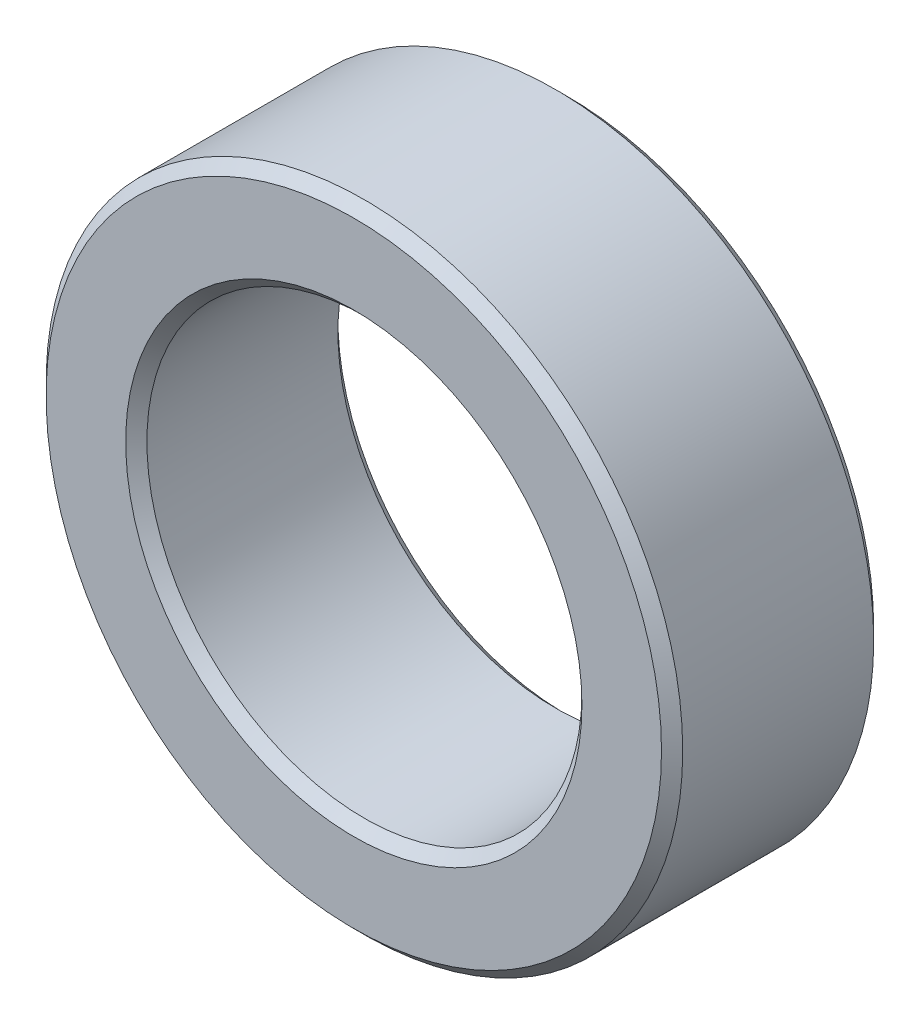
ISO-10303-21;
HEADER;
FILE_DESCRIPTION(('STEP AP214'),'2;1');
FILE_NAME('part.step','',(''),(''),'','','');
FILE_SCHEMA(('AUTOMOTIVE_DESIGN { 1 0 10303 214 1 1 1 1 }'));
ENDSEC;
DATA;
#1=APPLICATION_CONTEXT('core data for automotive mechanical design processes');
#2=APPLICATION_PROTOCOL_DEFINITION('international standard','automotive_design',2000,#1);
#3=PRODUCT_CONTEXT('',#1,'mechanical');
#4=PRODUCT('Part','Part','',(#3));
#5=PRODUCT_RELATED_PRODUCT_CATEGORY('part','',(#4));
#6=PRODUCT_DEFINITION_FORMATION('','',#4);
#7=PRODUCT_DEFINITION_CONTEXT('part definition',#1,'design');
#8=PRODUCT_DEFINITION('design','',#6,#7);
#9=PRODUCT_DEFINITION_SHAPE('','',#8);
#10=(LENGTH_UNIT() NAMED_UNIT(*) SI_UNIT(.MILLI.,.METRE.));
#11=(NAMED_UNIT(*) PLANE_ANGLE_UNIT() SI_UNIT($,.RADIAN.));
#12=(NAMED_UNIT(*) SI_UNIT($,.STERADIAN.) SOLID_ANGLE_UNIT());
#13=UNCERTAINTY_MEASURE_WITH_UNIT(LENGTH_MEASURE(1.E-05),#10,'distance_accuracy_value','');
#14=(GEOMETRIC_REPRESENTATION_CONTEXT(3) GLOBAL_UNCERTAINTY_ASSIGNED_CONTEXT((#13)) GLOBAL_UNIT_ASSIGNED_CONTEXT((#10,
#11,#12)) REPRESENTATION_CONTEXT('',''));
#15=CARTESIAN_POINT('',(0.,0.,0.));
#16=DIRECTION('',(0.,0.,1.));
#17=DIRECTION('',(1.,0.,0.));
#18=AXIS2_PLACEMENT_3D('',#15,#16,#17);
#19=CARTESIAN_POINT('',(0.,0.,2.));
#20=DIRECTION('',(0.,0.,1.));
#21=DIRECTION('',(1.,0.,0.));
#22=AXIS2_PLACEMENT_3D('',#19,#20,#21);
#23=PLANE('',#22);
#24=CARTESIAN_POINT('',(0.,0.,2.));
#25=DIRECTION('',(0.,0.,1.));
#26=DIRECTION('',(1.,0.,0.));
#27=AXIS2_PLACEMENT_3D('',#24,#25,#26);
#28=CIRCLE('',#27,4.3);
#29=CARTESIAN_POINT('',(4.3,0.,2.));
#30=VERTEX_POINT('',#29);
#31=EDGE_CURVE('E10',#30,#30,#28,.F.);
#32=ORIENTED_EDGE('',*,*,#31,.T.);
#33=EDGE_LOOP('',(#32));
#34=FACE_BOUND('',#33,.T.);
#35=CARTESIAN_POINT('',(0.,0.,2.));
#36=DIRECTION('',(0.,0.,1.));
#37=DIRECTION('',(1.,0.,0.));
#38=AXIS2_PLACEMENT_3D('',#35,#36,#37);
#39=CIRCLE('',#38,5.8);
#40=CARTESIAN_POINT('',(5.8,0.,2.));
#41=VERTEX_POINT('',#40);
#42=EDGE_CURVE('E45',#41,#41,#39,.T.);
#43=ORIENTED_EDGE('',*,*,#42,.T.);
#44=EDGE_LOOP('',(#43));
#45=FACE_BOUND('',#44,.T.);
#46=ADVANCED_FACE('F37',(#34,#45),#23,.T.);
#47=CARTESIAN_POINT('',(0.,0.,-2.));
#48=DIRECTION('',(0.,0.,1.));
#49=DIRECTION('',(1.,0.,0.));
#50=AXIS2_PLACEMENT_3D('',#47,#48,#49);
#51=PLANE('',#50);
#52=CARTESIAN_POINT('',(0.,0.,-2.));
#53=DIRECTION('',(0.,0.,1.));
#54=DIRECTION('',(1.,0.,0.));
#55=AXIS2_PLACEMENT_3D('',#52,#53,#54);
#56=CIRCLE('',#55,5.8);
#57=CARTESIAN_POINT('',(5.8,0.,-2.));
#58=VERTEX_POINT('',#57);
#59=EDGE_CURVE('E63',#58,#58,#56,.F.);
#60=ORIENTED_EDGE('',*,*,#59,.T.);
#61=EDGE_LOOP('',(#60));
#62=FACE_BOUND('',#61,.T.);
#63=CARTESIAN_POINT('',(0.,0.,-2.));
#64=DIRECTION('',(0.,0.,1.));
#65=DIRECTION('',(1.,0.,0.));
#66=AXIS2_PLACEMENT_3D('',#63,#64,#65);
#67=CIRCLE('',#66,4.3);
#68=CARTESIAN_POINT('',(4.3,0.,-2.));
#69=VERTEX_POINT('',#68);
#70=EDGE_CURVE('E67',#69,#69,#67,.T.);
#71=ORIENTED_EDGE('',*,*,#70,.T.);
#72=EDGE_LOOP('',(#71));
#73=FACE_BOUND('',#72,.T.);
#74=ADVANCED_FACE('F89',(#62,#73),#51,.F.);
#75=CARTESIAN_POINT('',(0.,0.,2.));
#76=DIRECTION('',(0.,0.,-1.));
#77=DIRECTION('',(-1.,0.,0.));
#78=AXIS2_PLACEMENT_3D('',#75,#76,#77);
#79=CYLINDRICAL_SURFACE('',#78,6.);
#80=CARTESIAN_POINT('',(0.,0.,-1.8));
#81=DIRECTION('',(0.,0.,1.));
#82=DIRECTION('',(1.,0.,0.));
#83=AXIS2_PLACEMENT_3D('',#80,#81,#82);
#84=CIRCLE('',#83,6.);
#85=CARTESIAN_POINT('',(6.,0.,-1.8));
#86=VERTEX_POINT('',#85);
#87=EDGE_CURVE('E70',#86,#86,#84,.T.);
#88=ORIENTED_EDGE('',*,*,#87,.T.);
#89=EDGE_LOOP('',(#88));
#90=FACE_BOUND('',#89,.T.);
#91=CARTESIAN_POINT('',(0.,0.,1.79999999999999));
#92=DIRECTION('',(0.,0.,1.));
#93=DIRECTION('',(1.,0.,0.));
#94=AXIS2_PLACEMENT_3D('',#91,#92,#93);
#95=CIRCLE('',#94,6.);
#96=CARTESIAN_POINT('',(6.,0.,1.79999999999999));
#97=VERTEX_POINT('',#96);
#98=EDGE_CURVE('E73',#97,#97,#95,.F.);
#99=ORIENTED_EDGE('',*,*,#98,.T.);
#100=EDGE_LOOP('',(#99));
#101=FACE_BOUND('',#100,.T.);
#102=ADVANCED_FACE('F78',(#90,#101),#79,.T.);
#103=CARTESIAN_POINT('',(0.,0.,2.));
#104=DIRECTION('',(0.,0.,-1.));
#105=DIRECTION('',(-1.,0.,0.));
#106=AXIS2_PLACEMENT_3D('',#103,#104,#105);
#107=CYLINDRICAL_SURFACE('',#106,4.1);
#108=CARTESIAN_POINT('',(0.,0.,-1.8));
#109=DIRECTION('',(0.,0.,1.));
#110=DIRECTION('',(1.,0.,0.));
#111=AXIS2_PLACEMENT_3D('',#108,#109,#110);
#112=CIRCLE('',#111,4.1);
#113=CARTESIAN_POINT('',(4.1,0.,-1.8));
#114=VERTEX_POINT('',#113);
#115=EDGE_CURVE('E52',#114,#114,#112,.F.);
#116=ORIENTED_EDGE('',*,*,#115,.T.);
#117=EDGE_LOOP('',(#116));
#118=FACE_BOUND('',#117,.T.);
#119=CARTESIAN_POINT('',(0.,0.,1.8));
#120=DIRECTION('',(0.,0.,1.));
#121=DIRECTION('',(1.,0.,0.));
#122=AXIS2_PLACEMENT_3D('',#119,#120,#121);
#123=CIRCLE('',#122,4.1);
#124=CARTESIAN_POINT('',(4.1,0.,1.8));
#125=VERTEX_POINT('',#124);
#126=EDGE_CURVE('E57',#125,#125,#123,.T.);
#127=ORIENTED_EDGE('',*,*,#126,.T.);
#128=EDGE_LOOP('',(#127));
#129=FACE_BOUND('',#128,.T.);
#130=ADVANCED_FACE('F97',(#118,#129),#107,.F.);
#131=CARTESIAN_POINT('',(0.,0.,-1.8));
#132=DIRECTION('',(0.,0.,1.));
#133=DIRECTION('',(1.,0.,0.));
#134=AXIS2_PLACEMENT_3D('',#131,#132,#133);
#135=CONICAL_SURFACE('',#134,6.,0.78539816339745);
#136=ORIENTED_EDGE('',*,*,#59,.F.);
#137=EDGE_LOOP('',(#136));
#138=FACE_BOUND('',#137,.T.);
#139=ORIENTED_EDGE('',*,*,#87,.F.);
#140=EDGE_LOOP('',(#139));
#141=FACE_BOUND('',#140,.T.);
#142=ADVANCED_FACE('F102',(#138,#141),#135,.T.);
#143=CARTESIAN_POINT('',(0.,0.,-2.));
#144=DIRECTION('',(0.,0.,-1.));
#145=DIRECTION('',(-1.,0.,0.));
#146=AXIS2_PLACEMENT_3D('',#143,#144,#145);
#147=CONICAL_SURFACE('',#146,4.3,0.785398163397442);
#148=ORIENTED_EDGE('',*,*,#115,.F.);
#149=EDGE_LOOP('',(#148));
#150=FACE_BOUND('',#149,.T.);
#151=ORIENTED_EDGE('',*,*,#70,.F.);
#152=EDGE_LOOP('',(#151));
#153=FACE_BOUND('',#152,.T.);
#154=ADVANCED_FACE('F86',(#150,#153),#147,.F.);
#155=CARTESIAN_POINT('',(0.,0.,1.8));
#156=DIRECTION('',(0.,0.,1.));
#157=DIRECTION('',(1.,0.,0.));
#158=AXIS2_PLACEMENT_3D('',#155,#156,#157);
#159=CONICAL_SURFACE('',#158,4.1,0.785398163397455);
#160=ORIENTED_EDGE('',*,*,#31,.F.);
#161=EDGE_LOOP('',(#160));
#162=FACE_BOUND('',#161,.T.);
#163=ORIENTED_EDGE('',*,*,#126,.F.);
#164=EDGE_LOOP('',(#163));
#165=FACE_BOUND('',#164,.T.);
#166=ADVANCED_FACE('F82',(#162,#165),#159,.F.);
#167=CARTESIAN_POINT('',(0.,0.,2.));
#168=DIRECTION('',(0.,0.,-1.));
#169=DIRECTION('',(-1.,0.,0.));
#170=AXIS2_PLACEMENT_3D('',#167,#168,#169);
#171=CONICAL_SURFACE('',#170,5.8,0.785398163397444);
#172=ORIENTED_EDGE('',*,*,#98,.F.);
#173=EDGE_LOOP('',(#172));
#174=FACE_BOUND('',#173,.T.);
#175=ORIENTED_EDGE('',*,*,#42,.F.);
#176=EDGE_LOOP('',(#175));
#177=FACE_BOUND('',#176,.T.);
#178=ADVANCED_FACE('F39',(#174,#177),#171,.T.);
#179=CLOSED_SHELL('',(#46,#74,#102,#130,#142,#154,#166,#178));
#180=MANIFOLD_SOLID_BREP('B2',#179);
#181=ADVANCED_BREP_SHAPE_REPRESENTATION('',(#18,#180),#14);
#182=SHAPE_DEFINITION_REPRESENTATION(#9,#181);
ENDSEC;
END-ISO-10303-21;
